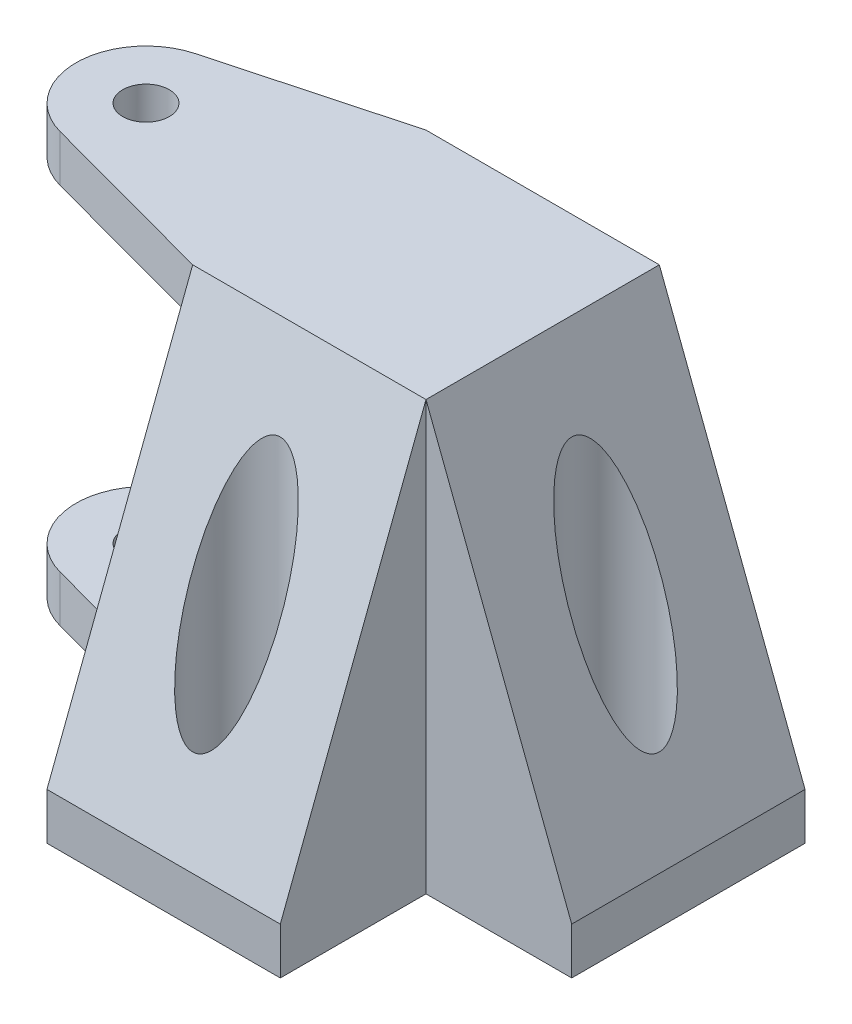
from build123d import *

# Parameters (mm, degrees)
BOSS_EXTRUDE1_DEPTH = 40
BOSS_EXTRUDE2_DEPTH = 73.391828
SKETCH4_W           = 40
SKETCH4_H           = 57.391828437
CUT_EXTRUDE1_DEPTH  = 73
BOSS_EXTRUDE4_DEPTH = 40
SKETCH8_R           = 4
CUT_EXTRUDE2_DEPTH  = 127.52479018
SKETCH10_R          = 7.5
CUT_EXTRUDE3_DEPTH  = 124.691569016


with BuildPart() as part:
    # Sketch2 → Boss-Extrude1 (new body)
    with BuildSketch(Plane.XY):
        Polygon((0, 0), (-40, 0), (-40, 73.391828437), (0, 73.391828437), (24.978165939, 8), (24.978165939, 0), align=None)
    extrude(amount=BOSS_EXTRUDE1_DEPTH)

    # Sketch3 → Boss-Extrude2 (add)
    with BuildSketch(Plane(origin=(0, 73.391828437, 0), x_dir=(1, 0, 0), z_dir=(0, 1, 0))):
        with BuildLine():
            Line((-40, -40), (-71.131560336, -31.584184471))
            ThreePointArc((-71.131560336, -31.584184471), (-80, -20), (-71.131560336, -8.415815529))
            Line((-71.131560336, -8.415815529), (-40, 0))
            Line((-40, 0), (-40, -40))
        make_face()
    extrude(amount=-BOSS_EXTRUDE2_DEPTH)

    # Sketch4 → Cut-Extrude1 (cut)
    with BuildSketch(Plane.XY):
        with Locations((-60, 36.695914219)):
            Rectangle(SKETCH4_W, SKETCH4_H)
    extrude(amount=CUT_EXTRUDE1_DEPTH, mode=Mode.SUBTRACT)

    # Sketch6 → Boss-Extrude4 (add)
    with BuildSketch(Plane(origin=(0, 0, 0), x_dir=(0, 0, -1), z_dir=(1, 0, 0))):
        Polygon((-40, 73.391828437), (-64.978165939, 8), (-64.978165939, 0), (-40, 0), align=None)
    extrude(amount=-BOSS_EXTRUDE4_DEPTH)

    # Sketch8 → Cut-Extrude2 (cut, through all)
    with BuildSketch(Plane(origin=(0, 73.391828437, 0), x_dir=(1, 0, 0), z_dir=(0, 1, 0))):
        with Locations(Location((12.489082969, -20, 0), (0, 0, 270))):
            Circle(SKETCH8_R)
        with Locations(Location((-20, -52.489082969, 0), (0, 0, 270))):
            Circle(SKETCH8_R)
        with Locations(Location((-68, -20, 0), (0, 0, 270))):
            Circle(SKETCH8_R)
    extrude(amount=-CUT_EXTRUDE2_DEPTH, mode=Mode.SUBTRACT)

    # Sketch10 → Cut-Extrude3 (cut, through all)
    with BuildSketch(Plane(origin=(0, 5, 0), x_dir=(1, 0, 0), z_dir=(0, 1, 0))):
        with Locations((12.489082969, -20)):
            Circle(SKETCH10_R)
        with Locations(Location((-20, -52.489082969, 0), (0, 0, 270))):
            Circle(SKETCH10_R)
    extrude(amount=CUT_EXTRUDE3_DEPTH, mode=Mode.SUBTRACT)


solid = part.part
